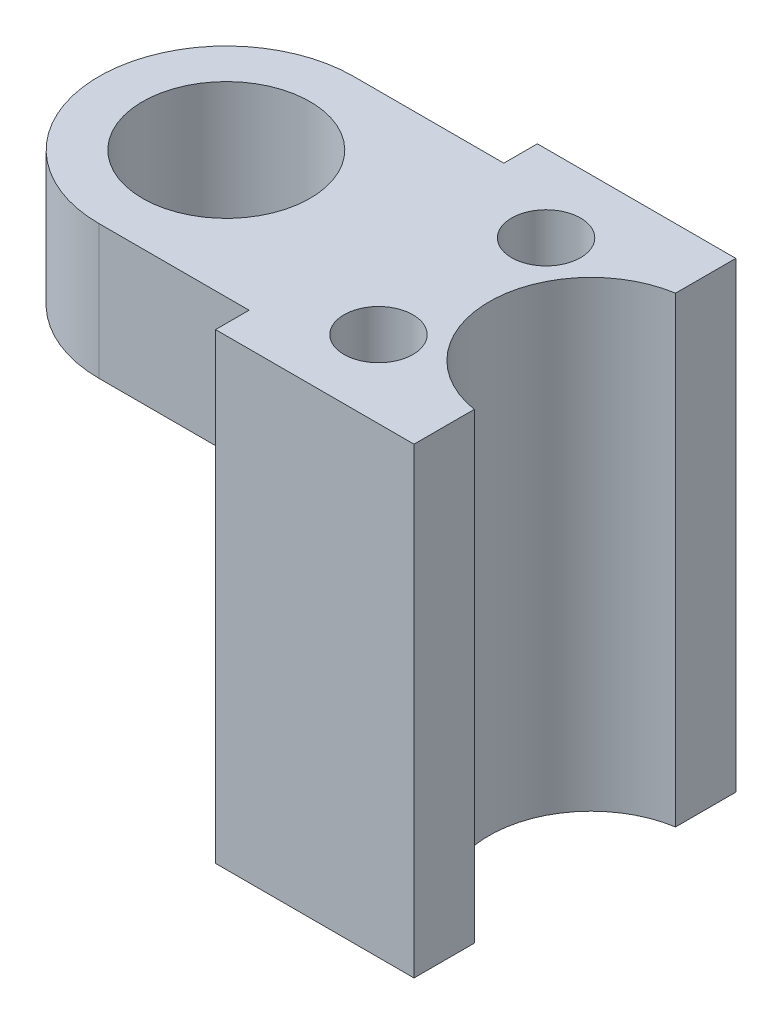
from build123d import *

# Parameters (mm, degrees)
SKETCH1_W             = 16.51
SKETCH1_H             = 15.24
BOSS_EXTRUDE1_DEPTH   = 21.8948
CUT_EXTRUDE1_DEPTH    = 15.5448
SKETCH5_R             = 3.96875
CUT_EXTRUDE2_DEPTH    = 29.097371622
F_4_CLEARANCE_HOLE1_D = 3.2639
SKETCH8_R             = 4.826
CUT_EXTRUDE3_DEPTH    = 29.097371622
CUT_EXTRUDE4_DEPTH    = 24.488738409


with BuildPart() as part:
    # Sketch1 → Boss-Extrude1 (new body)
    with BuildSketch(Plane(origin=(0, 0, 0), x_dir=(1, 0, 0), z_dir=(0, 1, 0))):
        with BuildLine():
            Line((-8.255, 7.62), (-8.255, -7.62))
            ThreePointArc((-8.255, -7.62), (-15.875, 0), (-8.255, 7.62))
        make_face()
        Rectangle(SKETCH1_W, SKETCH1_H)
    extrude(amount=BOSS_EXTRUDE1_DEPTH)

    # Sketch2 → Cut-Extrude1 (cut)
    with BuildSketch(Plane.XZ):
        with BuildLine():
            Line((-1.143, -7.62), (-1.143, 7.62))
            Line((-1.143, 7.62), (-8.255, 7.62))
            ThreePointArc((-8.255, 7.62), (-15.875, 0), (-8.255, -7.62))
            Line((-8.255, -7.62), (-1.143, -7.62))
        make_face()
    extrude(amount=-CUT_EXTRUDE1_DEPTH, mode=Mode.SUBTRACT)

    # Sketch5 → Cut-Extrude2 (cut, through all)
    with BuildSketch(Plane(origin=(0, 21.8948, 0), x_dir=(1, 0, 0), z_dir=(0, 1, 0))):
        with Locations(Location((-8.255, 0, 0), (0, 0, 270))):
            Circle(SKETCH5_R)
    extrude(amount=-CUT_EXTRUDE2_DEPTH, mode=Mode.SUBTRACT)

    # 4 Clearance Hole1 (through all)
    with Locations(Plane(origin=(2.921, 21.8948, -3.96875), x_dir=(0, 0, 1), z_dir=(0, 1, 0))):
        with Locations((0, 0), (7.9375, 0)):
            Hole(F_4_CLEARANCE_HOLE1_D / 2)

    # Sketch8 → Cut-Extrude3 (cut, through all)
    with BuildSketch(Plane(origin=(0, 21.8948, 0), x_dir=(1, 0, 0), z_dir=(0, 1, 0))):
        with Locations((9.017, 0)):
            Circle(SKETCH8_R)
    extrude(amount=-CUT_EXTRUDE3_DEPTH, mode=Mode.SUBTRACT)

    # Sketch9 → Cut-Extrude4 (cut, through all)
    with BuildSketch(Plane.XZ.offset(-15.5448)):
        with BuildLine():
            Line((-1.143, -6.0325), (-8.255, -6.0325))
            ThreePointArc((-8.255, -6.0325), (-14.2875, 0), (-8.255, 6.0325))
            Line((-8.255, 6.0325), (-1.143, 6.0325))
            Line((-1.143, 6.0325), (-1.143, 7.62))
            Line((-1.143, 7.62), (-8.255, 7.62))
            ThreePointArc((-8.255, 7.62), (-15.875, 0), (-8.255, -7.62))
            Line((-8.255, -7.62), (-1.143, -7.62))
            Line((-1.143, -7.62), (-1.143, -6.0325))
        make_face()
    extrude(amount=-CUT_EXTRUDE4_DEPTH, mode=Mode.SUBTRACT)


solid = part.part
